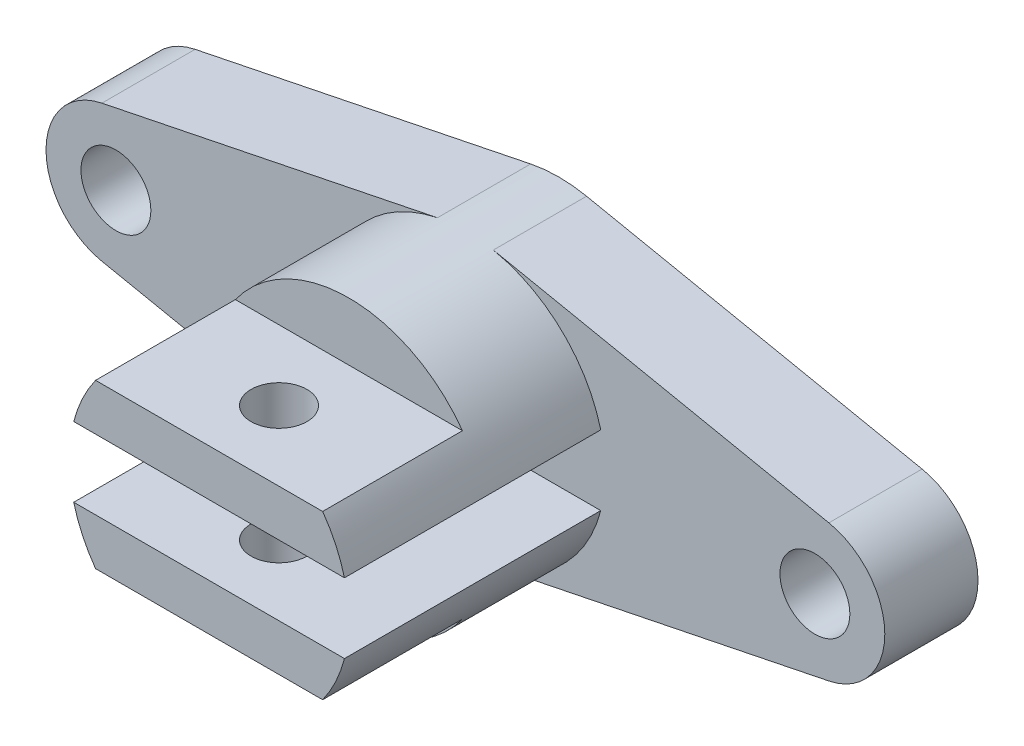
from build123d import *

# Parameters (mm, degrees)
SALIENTE_EXTRUIR1_DEPTH    = 20
CROQUIS9_8_R               = 7.5
CORTAR_EXTRUIR1_DEPTH      = 20
CROQUIS9_10_R              = 7.5
CORTAR_EXTRUIR2_DEPTH      = 20
SALIENTE_EXTRUIR2_DEPTH    = 45
SALIENTE_EXTRUIR3_DEPTH    = 75
CORTAR_EXTRUIR4_DEPTH      = 61
CORTAR_EXTRUIR4_DEPTH_BACK = 52
CROQUIS12_R                = 6


with BuildPart() as part:
    # Croquis9 → Saliente-Extruir1 (new body)
    with BuildSketch(Plane.XY):
        with BuildLine():
            Line((-78, 14.696938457), (-6, 29.393876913))
            ThreePointArc((-6, 29.393876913), (0, 30), (6, 29.393876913))
            Line((6, 29.393876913), (78, 14.696938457))
            ThreePointArc((78, 14.696938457), (90, 0), (78, -14.696938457))
            Line((78, -14.696938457), (6, -29.393876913))
            ThreePointArc((6, -29.393876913), (0, -30), (-6, -29.393876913))
            Line((-6, -29.393876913), (-78, -14.696938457))
            ThreePointArc((-78, -14.696938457), (-90, 0), (-78, 14.696938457))
        make_face()
    extrude(amount=SALIENTE_EXTRUIR1_DEPTH)

    # Croquis9_8 → Cortar-Extruir1 (cut)
    with BuildSketch(Plane.XY):
        with Locations((-75, 0)):
            Circle(CROQUIS9_8_R)
    extrude(amount=CORTAR_EXTRUIR1_DEPTH, mode=Mode.SUBTRACT)

    # Croquis9_10 → Cortar-Extruir2 (cut)
    with BuildSketch(Plane.XY):
        with Locations((75, 0)):
            Circle(CROQUIS9_10_R)
    extrude(amount=CORTAR_EXTRUIR2_DEPTH, mode=Mode.SUBTRACT)

    # Croquis10 → Saliente-Extruir2 (add)
    with BuildSketch(Plane.XY):
        with BuildLine():
            Line((-29.047375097, 7.5), (29.047375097, 7.5))
            ThreePointArc((29.047375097, 7.5), (0, 30), (-29.047375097, 7.5))
        make_face()
        with BuildLine():
            Line((-29.047375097, -7.5), (29.047375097, -7.5))
            ThreePointArc((29.047375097, -7.5), (0, -30), (-29.047375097, -7.5))
        make_face()
    extrude(amount=SALIENTE_EXTRUIR2_DEPTH)

    # Croquis11 → Saliente-Extruir3 (add)
    with BuildSketch(Plane.XY):
        with BuildLine():
            Line((-24.366985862, 17.5), (24.366985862, 17.5))
            ThreePointArc((24.366985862, 17.5), (27.171188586, 12.717173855), (29.047375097, 7.5))
            Line((29.047375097, 7.5), (-29.047375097, 7.5))
            ThreePointArc((-29.047375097, 7.5), (-27.171188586, 12.717173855), (-24.366985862, 17.5))
        make_face()
        with BuildLine():
            Line((-24.366985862, -17.5), (24.366985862, -17.5))
            ThreePointArc((24.366985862, -17.5), (27.171188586, -12.717173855), (29.047375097, -7.5))
            Line((29.047375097, -7.5), (-29.047375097, -7.5))
            ThreePointArc((-29.047375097, -7.5), (-27.171188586, -12.717173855), (-24.366985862, -17.5))
        make_face()
    extrude(amount=SALIENTE_EXTRUIR3_DEPTH)

    # Croquis12 → Cortar-Extruir4 (cut, two sides: drawn at the far end of the back side and taken through both)
    with BuildSketch(Plane(origin=(0, 0, 0), x_dir=(1, 0, 0), z_dir=(0, 1, 0)).offset(-CORTAR_EXTRUIR4_DEPTH_BACK)):
        with Locations(Location((0, -60, 0), (0, 0, 90))):
            Circle(CROQUIS12_R)
    extrude(amount=CORTAR_EXTRUIR4_DEPTH + CORTAR_EXTRUIR4_DEPTH_BACK, mode=Mode.SUBTRACT)


solid = part.part
